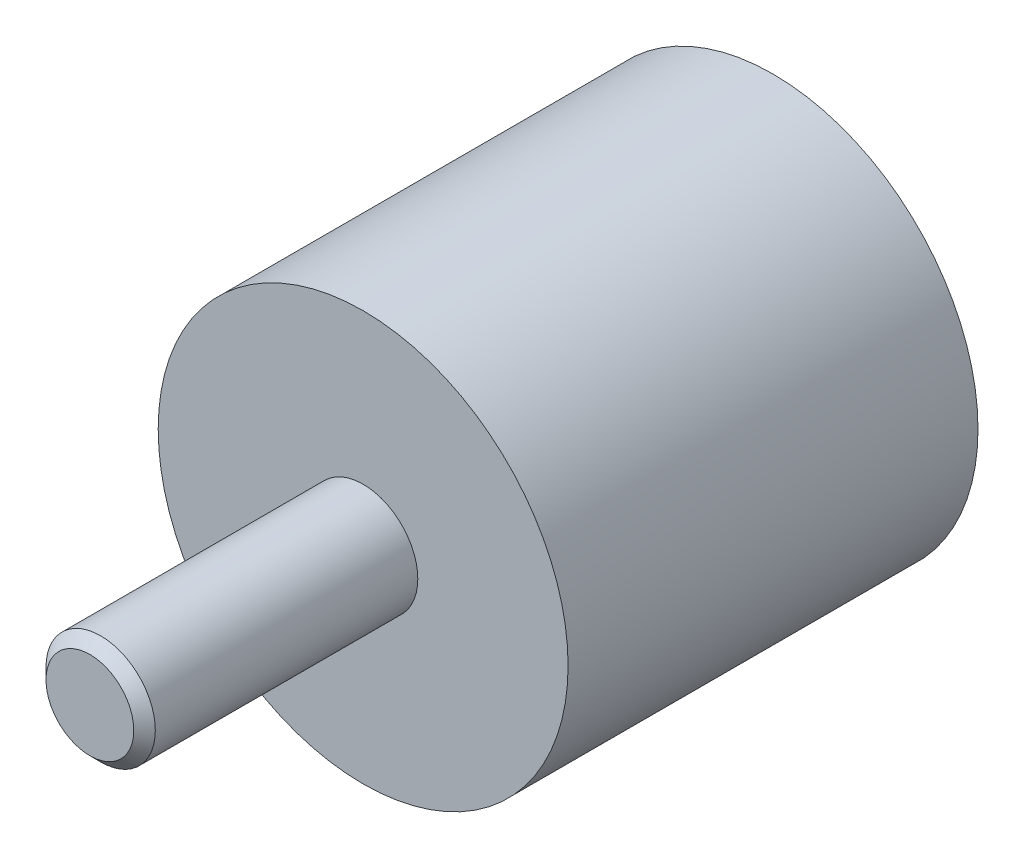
ISO-10303-21;
HEADER;
FILE_DESCRIPTION(('STEP AP214'),'2;1');
FILE_NAME('part.step','',(''),(''),'','','');
FILE_SCHEMA(('AUTOMOTIVE_DESIGN { 1 0 10303 214 1 1 1 1 }'));
ENDSEC;
DATA;
#1=APPLICATION_CONTEXT('core data for automotive mechanical design processes');
#2=APPLICATION_PROTOCOL_DEFINITION('international standard','automotive_design',2000,#1);
#3=PRODUCT_CONTEXT('',#1,'mechanical');
#4=PRODUCT('Part','Part','',(#3));
#5=PRODUCT_RELATED_PRODUCT_CATEGORY('part','',(#4));
#6=PRODUCT_DEFINITION_FORMATION('','',#4);
#7=PRODUCT_DEFINITION_CONTEXT('part definition',#1,'design');
#8=PRODUCT_DEFINITION('design','',#6,#7);
#9=PRODUCT_DEFINITION_SHAPE('','',#8);
#10=(LENGTH_UNIT() NAMED_UNIT(*) SI_UNIT(.MILLI.,.METRE.));
#11=(NAMED_UNIT(*) PLANE_ANGLE_UNIT() SI_UNIT($,.RADIAN.));
#12=(NAMED_UNIT(*) SI_UNIT($,.STERADIAN.) SOLID_ANGLE_UNIT());
#13=UNCERTAINTY_MEASURE_WITH_UNIT(LENGTH_MEASURE(1.E-05),#10,'distance_accuracy_value','');
#14=(GEOMETRIC_REPRESENTATION_CONTEXT(3) GLOBAL_UNCERTAINTY_ASSIGNED_CONTEXT((#13)) GLOBAL_UNIT_ASSIGNED_CONTEXT((#10,
#11,#12)) REPRESENTATION_CONTEXT('',''));
#15=CARTESIAN_POINT('',(0.,0.,0.));
#16=DIRECTION('',(0.,0.,1.));
#17=DIRECTION('',(1.,0.,0.));
#18=AXIS2_PLACEMENT_3D('',#15,#16,#17);
#19=CARTESIAN_POINT('',(0.,0.,0.5));
#20=DIRECTION('',(0.,0.,1.));
#21=DIRECTION('',(0.,-1.,0.));
#22=AXIS2_PLACEMENT_3D('',#19,#20,#21);
#23=CYLINDRICAL_SURFACE('',#22,15.);
#24=CARTESIAN_POINT('',(0.,0.,0.));
#25=DIRECTION('',(0.,0.,1.));
#26=DIRECTION('',(0.,-1.,0.));
#27=AXIS2_PLACEMENT_3D('',#24,#25,#26);
#28=CIRCLE('',#27,15.);
#29=CARTESIAN_POINT('',(0.,-15.,0.));
#30=VERTEX_POINT('',#29);
#31=EDGE_CURVE('E27',#30,#30,#28,.T.);
#32=ORIENTED_EDGE('',*,*,#31,.T.);
#33=EDGE_LOOP('',(#32));
#34=FACE_BOUND('',#33,.T.);
#35=CARTESIAN_POINT('',(0.,0.,30.));
#36=DIRECTION('',(0.,0.,-1.));
#37=DIRECTION('',(-1.,0.,0.));
#38=AXIS2_PLACEMENT_3D('',#35,#36,#37);
#39=CIRCLE('',#38,15.);
#40=CARTESIAN_POINT('',(-15.,0.,30.));
#41=VERTEX_POINT('',#40);
#42=EDGE_CURVE('E32',#41,#41,#39,.T.);
#43=ORIENTED_EDGE('',*,*,#42,.T.);
#44=EDGE_LOOP('',(#43));
#45=FACE_BOUND('',#44,.T.);
#46=ADVANCED_FACE('F12',(#34,#45),#23,.T.);
#47=CARTESIAN_POINT('',(15.,0.,0.));
#48=DIRECTION('',(0.,0.,-1.));
#49=DIRECTION('',(0.,1.,0.));
#50=AXIS2_PLACEMENT_3D('',#47,#48,#49);
#51=PLANE('',#50);
#52=CARTESIAN_POINT('',(0.,0.,0.));
#53=DIRECTION('',(0.,0.,-1.));
#54=DIRECTION('',(0.,1.,0.));
#55=AXIS2_PLACEMENT_3D('',#52,#53,#54);
#56=CIRCLE('',#55,4.45);
#57=CARTESIAN_POINT('',(0.,4.45,0.));
#58=VERTEX_POINT('',#57);
#59=EDGE_CURVE('E19',#58,#58,#56,.F.);
#60=ORIENTED_EDGE('',*,*,#59,.T.);
#61=EDGE_LOOP('',(#60));
#62=FACE_BOUND('',#61,.T.);
#63=ORIENTED_EDGE('',*,*,#31,.F.);
#64=EDGE_LOOP('',(#63));
#65=FACE_BOUND('',#64,.T.);
#66=ADVANCED_FACE('F49',(#62,#65),#51,.T.);
#67=CARTESIAN_POINT('',(0.,0.,0.));
#68=DIRECTION('',(0.,0.,1.));
#69=DIRECTION('',(0.,-1.,0.));
#70=AXIS2_PLACEMENT_3D('',#67,#68,#69);
#71=CYLINDRICAL_SURFACE('',#70,4.);
#72=CARTESIAN_POINT('',(0.,0.,0.449999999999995));
#73=DIRECTION('',(0.,0.,-1.));
#74=DIRECTION('',(0.,1.,0.));
#75=AXIS2_PLACEMENT_3D('',#72,#73,#74);
#76=CIRCLE('',#75,4.);
#77=CARTESIAN_POINT('',(0.,4.,0.449999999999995));
#78=VERTEX_POINT('',#77);
#79=EDGE_CURVE('E23',#78,#78,#76,.T.);
#80=ORIENTED_EDGE('',*,*,#79,.T.);
#81=EDGE_LOOP('',(#80));
#82=FACE_BOUND('',#81,.T.);
#83=CARTESIAN_POINT('',(0.,0.,8.));
#84=DIRECTION('',(0.,0.,-1.));
#85=DIRECTION('',(-1.,0.,0.));
#86=AXIS2_PLACEMENT_3D('',#83,#84,#85);
#87=CIRCLE('',#86,4.);
#88=CARTESIAN_POINT('',(-4.,0.,8.));
#89=VERTEX_POINT('',#88);
#90=EDGE_CURVE('E41',#89,#89,#87,.T.);
#91=ORIENTED_EDGE('',*,*,#90,.F.);
#92=EDGE_LOOP('',(#91));
#93=FACE_BOUND('',#92,.T.);
#94=ADVANCED_FACE('F47',(#82,#93),#71,.F.);
#95=CARTESIAN_POINT('',(0.,0.,0.449999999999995));
#96=DIRECTION('',(0.,0.,-1.));
#97=DIRECTION('',(0.,1.,0.));
#98=AXIS2_PLACEMENT_3D('',#95,#96,#97);
#99=CONICAL_SURFACE('',#98,4.,0.785398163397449);
#100=ORIENTED_EDGE('',*,*,#59,.F.);
#101=EDGE_LOOP('',(#100));
#102=FACE_BOUND('',#101,.T.);
#103=ORIENTED_EDGE('',*,*,#79,.F.);
#104=EDGE_LOOP('',(#103));
#105=FACE_BOUND('',#104,.T.);
#106=ADVANCED_FACE('F14',(#102,#105),#99,.F.);
#107=CARTESIAN_POINT('',(0.,15.,30.));
#108=DIRECTION('',(0.,0.,1.));
#109=DIRECTION('',(1.,0.,0.));
#110=AXIS2_PLACEMENT_3D('',#107,#108,#109);
#111=PLANE('',#110);
#112=CARTESIAN_POINT('',(0.,0.,30.));
#113=DIRECTION('',(0.,0.,1.));
#114=DIRECTION('',(1.,0.,0.));
#115=AXIS2_PLACEMENT_3D('',#112,#113,#114);
#116=CIRCLE('',#115,4.);
#117=CARTESIAN_POINT('',(4.,0.,30.));
#118=VERTEX_POINT('',#117);
#119=EDGE_CURVE('E8',#118,#118,#116,.F.);
#120=ORIENTED_EDGE('',*,*,#119,.T.);
#121=EDGE_LOOP('',(#120));
#122=FACE_BOUND('',#121,.T.);
#123=ORIENTED_EDGE('',*,*,#42,.F.);
#124=EDGE_LOOP('',(#123));
#125=FACE_BOUND('',#124,.T.);
#126=ADVANCED_FACE('F57',(#122,#125),#111,.T.);
#127=CARTESIAN_POINT('',(0.,0.,15.));
#128=DIRECTION('',(0.,0.,1.));
#129=DIRECTION('',(0.,-1.,0.));
#130=AXIS2_PLACEMENT_3D('',#127,#128,#129);
#131=CYLINDRICAL_SURFACE('',#130,4.);
#132=ORIENTED_EDGE('',*,*,#119,.F.);
#133=EDGE_LOOP('',(#132));
#134=FACE_BOUND('',#133,.T.);
#135=CARTESIAN_POINT('',(0.,0.,49.2115763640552));
#136=DIRECTION('',(0.,0.,-1.));
#137=DIRECTION('',(-1.,0.,0.));
#138=AXIS2_PLACEMENT_3D('',#135,#136,#137);
#139=CIRCLE('',#138,4.);
#140=CARTESIAN_POINT('',(-4.,0.,49.2115763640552));
#141=VERTEX_POINT('',#140);
#142=EDGE_CURVE('E35',#141,#141,#139,.T.);
#143=ORIENTED_EDGE('',*,*,#142,.T.);
#144=EDGE_LOOP('',(#143));
#145=FACE_BOUND('',#144,.T.);
#146=ADVANCED_FACE('F70',(#134,#145),#131,.T.);
#147=CARTESIAN_POINT('',(0.,0.,49.2115763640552));
#148=DIRECTION('',(0.,0.,-1.));
#149=DIRECTION('',(-1.,0.,0.));
#150=AXIS2_PLACEMENT_3D('',#147,#148,#149);
#151=CONICAL_SURFACE('',#150,4.,0.785398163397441);
#152=CARTESIAN_POINT('',(0.,0.,50.));
#153=DIRECTION('',(0.,0.,-1.));
#154=DIRECTION('',(-1.,0.,0.));
#155=AXIS2_PLACEMENT_3D('',#152,#153,#154);
#156=CIRCLE('',#155,3.21157636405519);
#157=CARTESIAN_POINT('',(-3.21157636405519,0.,50.));
#158=VERTEX_POINT('',#157);
#159=EDGE_CURVE('E38',#158,#158,#156,.T.);
#160=ORIENTED_EDGE('',*,*,#159,.T.);
#161=EDGE_LOOP('',(#160));
#162=FACE_BOUND('',#161,.T.);
#163=ORIENTED_EDGE('',*,*,#142,.F.);
#164=EDGE_LOOP('',(#163));
#165=FACE_BOUND('',#164,.T.);
#166=ADVANCED_FACE('F75',(#162,#165),#151,.T.);
#167=CARTESIAN_POINT('',(0.,3.21157636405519,50.));
#168=DIRECTION('',(0.,0.,1.));
#169=DIRECTION('',(1.,0.,0.));
#170=AXIS2_PLACEMENT_3D('',#167,#168,#169);
#171=PLANE('',#170);
#172=ORIENTED_EDGE('',*,*,#159,.F.);
#173=EDGE_LOOP('',(#172));
#174=FACE_BOUND('',#173,.T.);
#175=ADVANCED_FACE('F80',(#174),#171,.T.);
#176=CARTESIAN_POINT('',(0.,0.,8.));
#177=DIRECTION('',(0.,0.,-1.));
#178=DIRECTION('',(-1.,0.,0.));
#179=AXIS2_PLACEMENT_3D('',#176,#177,#178);
#180=PLANE('',#179);
#181=ORIENTED_EDGE('',*,*,#90,.T.);
#182=EDGE_LOOP('',(#181));
#183=FACE_BOUND('',#182,.T.);
#184=ADVANCED_FACE('F45',(#183),#180,.T.);
#185=CLOSED_SHELL('',(#46,#66,#94,#106,#126,#146,#166,#175,#184));
#186=MANIFOLD_SOLID_BREP('B1',#185);
#187=ADVANCED_BREP_SHAPE_REPRESENTATION('',(#18,#186),#14);
#188=SHAPE_DEFINITION_REPRESENTATION(#9,#187);
ENDSEC;
END-ISO-10303-21;
